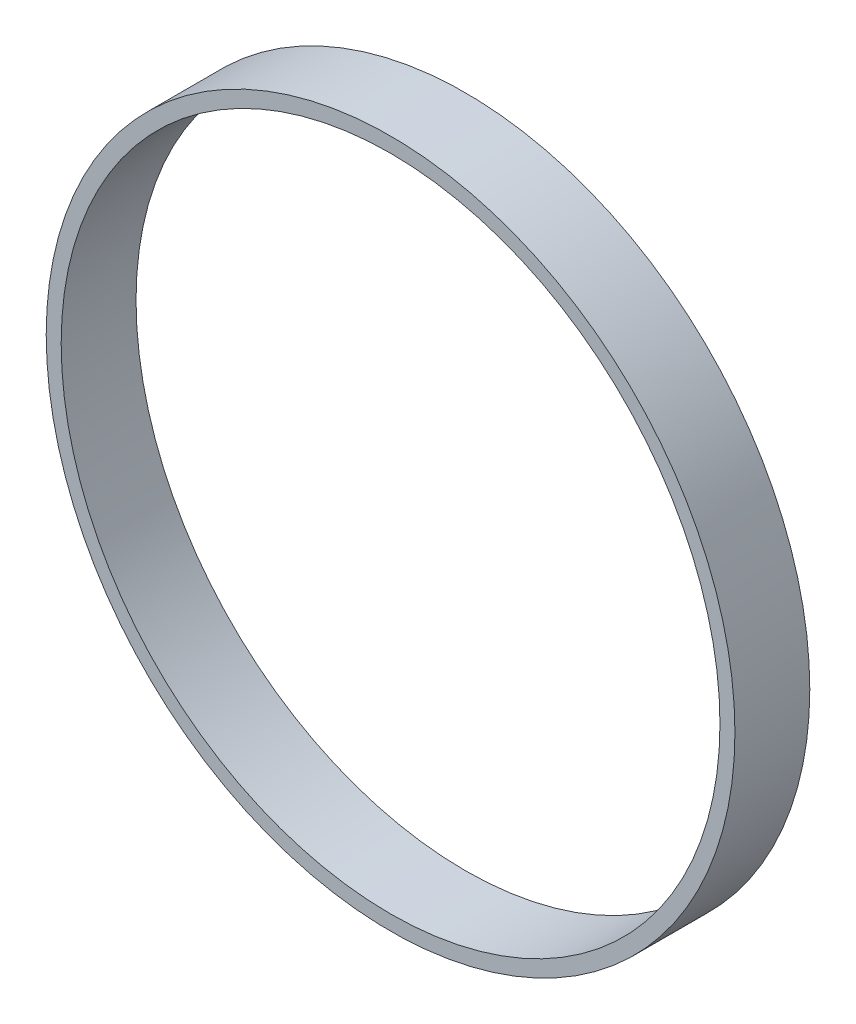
ISO-10303-21;
HEADER;
FILE_DESCRIPTION(('STEP AP214'),'2;1');
FILE_NAME('part.step','',(''),(''),'','','');
FILE_SCHEMA(('AUTOMOTIVE_DESIGN { 1 0 10303 214 1 1 1 1 }'));
ENDSEC;
DATA;
#1=APPLICATION_CONTEXT('core data for automotive mechanical design processes');
#2=APPLICATION_PROTOCOL_DEFINITION('international standard','automotive_design',2000,#1);
#3=PRODUCT_CONTEXT('',#1,'mechanical');
#4=PRODUCT('Part','Part','',(#3));
#5=PRODUCT_RELATED_PRODUCT_CATEGORY('part','',(#4));
#6=PRODUCT_DEFINITION_FORMATION('','',#4);
#7=PRODUCT_DEFINITION_CONTEXT('part definition',#1,'design');
#8=PRODUCT_DEFINITION('design','',#6,#7);
#9=PRODUCT_DEFINITION_SHAPE('','',#8);
#10=(LENGTH_UNIT() NAMED_UNIT(*) SI_UNIT(.MILLI.,.METRE.));
#11=(NAMED_UNIT(*) PLANE_ANGLE_UNIT() SI_UNIT($,.RADIAN.));
#12=(NAMED_UNIT(*) SI_UNIT($,.STERADIAN.) SOLID_ANGLE_UNIT());
#13=UNCERTAINTY_MEASURE_WITH_UNIT(LENGTH_MEASURE(1.E-05),#10,'distance_accuracy_value','');
#14=(GEOMETRIC_REPRESENTATION_CONTEXT(3) GLOBAL_UNCERTAINTY_ASSIGNED_CONTEXT((#13)) GLOBAL_UNIT_ASSIGNED_CONTEXT((#10,
#11,#12)) REPRESENTATION_CONTEXT('',''));
#15=CARTESIAN_POINT('',(0.,0.,0.));
#16=DIRECTION('',(0.,0.,1.));
#17=DIRECTION('',(1.,0.,0.));
#18=AXIS2_PLACEMENT_3D('',#15,#16,#17);
#19=CARTESIAN_POINT('',(0.,0.,5.));
#20=DIRECTION('',(0.,0.,1.));
#21=DIRECTION('',(1.,0.,0.));
#22=AXIS2_PLACEMENT_3D('',#19,#20,#21);
#23=PLANE('',#22);
#24=CARTESIAN_POINT('',(0.,0.,5.));
#25=DIRECTION('',(0.,0.,1.));
#26=DIRECTION('',(1.,0.,0.));
#27=AXIS2_PLACEMENT_3D('',#24,#25,#26);
#28=CIRCLE('',#27,23.);
#29=CARTESIAN_POINT('',(23.,0.,5.));
#30=VERTEX_POINT('',#29);
#31=EDGE_CURVE('E10',#30,#30,#28,.T.);
#32=ORIENTED_EDGE('',*,*,#31,.T.);
#33=EDGE_LOOP('',(#32));
#34=FACE_BOUND('',#33,.T.);
#35=CARTESIAN_POINT('',(0.,0.,5.));
#36=DIRECTION('',(0.,0.,1.));
#37=DIRECTION('',(1.,0.,0.));
#38=AXIS2_PLACEMENT_3D('',#35,#36,#37);
#39=CIRCLE('',#38,22.);
#40=CARTESIAN_POINT('',(22.,0.,5.));
#41=VERTEX_POINT('',#40);
#42=EDGE_CURVE('E35',#41,#41,#39,.T.);
#43=ORIENTED_EDGE('',*,*,#42,.F.);
#44=EDGE_LOOP('',(#43));
#45=FACE_BOUND('',#44,.T.);
#46=ADVANCED_FACE('F24',(#34,#45),#23,.T.);
#47=CARTESIAN_POINT('',(0.,0.,0.));
#48=DIRECTION('',(0.,0.,1.));
#49=DIRECTION('',(1.,0.,0.));
#50=AXIS2_PLACEMENT_3D('',#47,#48,#49);
#51=PLANE('',#50);
#52=CARTESIAN_POINT('',(0.,0.,0.));
#53=DIRECTION('',(0.,0.,1.));
#54=DIRECTION('',(1.,0.,0.));
#55=AXIS2_PLACEMENT_3D('',#52,#53,#54);
#56=CIRCLE('',#55,23.);
#57=CARTESIAN_POINT('',(23.,0.,0.));
#58=VERTEX_POINT('',#57);
#59=EDGE_CURVE('E31',#58,#58,#56,.T.);
#60=ORIENTED_EDGE('',*,*,#59,.F.);
#61=EDGE_LOOP('',(#60));
#62=FACE_BOUND('',#61,.T.);
#63=CARTESIAN_POINT('',(0.,0.,0.));
#64=DIRECTION('',(0.,0.,1.));
#65=DIRECTION('',(1.,0.,0.));
#66=AXIS2_PLACEMENT_3D('',#63,#64,#65);
#67=CIRCLE('',#66,22.);
#68=CARTESIAN_POINT('',(22.,0.,0.));
#69=VERTEX_POINT('',#68);
#70=EDGE_CURVE('E39',#69,#69,#67,.T.);
#71=ORIENTED_EDGE('',*,*,#70,.T.);
#72=EDGE_LOOP('',(#71));
#73=FACE_BOUND('',#72,.T.);
#74=ADVANCED_FACE('F45',(#62,#73),#51,.F.);
#75=CARTESIAN_POINT('',(0.,0.,5.));
#76=DIRECTION('',(0.,0.,-1.));
#77=DIRECTION('',(-1.,0.,0.));
#78=AXIS2_PLACEMENT_3D('',#75,#76,#77);
#79=CYLINDRICAL_SURFACE('',#78,23.);
#80=ORIENTED_EDGE('',*,*,#31,.F.);
#81=EDGE_LOOP('',(#80));
#82=FACE_BOUND('',#81,.T.);
#83=ORIENTED_EDGE('',*,*,#59,.T.);
#84=EDGE_LOOP('',(#83));
#85=FACE_BOUND('',#84,.T.);
#86=ADVANCED_FACE('F26',(#82,#85),#79,.T.);
#87=CARTESIAN_POINT('',(0.,0.,5.));
#88=DIRECTION('',(0.,0.,-1.));
#89=DIRECTION('',(-1.,0.,0.));
#90=AXIS2_PLACEMENT_3D('',#87,#88,#89);
#91=CYLINDRICAL_SURFACE('',#90,22.);
#92=ORIENTED_EDGE('',*,*,#42,.T.);
#93=EDGE_LOOP('',(#92));
#94=FACE_BOUND('',#93,.T.);
#95=ORIENTED_EDGE('',*,*,#70,.F.);
#96=EDGE_LOOP('',(#95));
#97=FACE_BOUND('',#96,.T.);
#98=ADVANCED_FACE('F47',(#94,#97),#91,.F.);
#99=CLOSED_SHELL('',(#46,#74,#86,#98));
#100=MANIFOLD_SOLID_BREP('B2',#99);
#101=ADVANCED_BREP_SHAPE_REPRESENTATION('',(#18,#100),#14);
#102=SHAPE_DEFINITION_REPRESENTATION(#9,#101);
ENDSEC;
END-ISO-10303-21;
